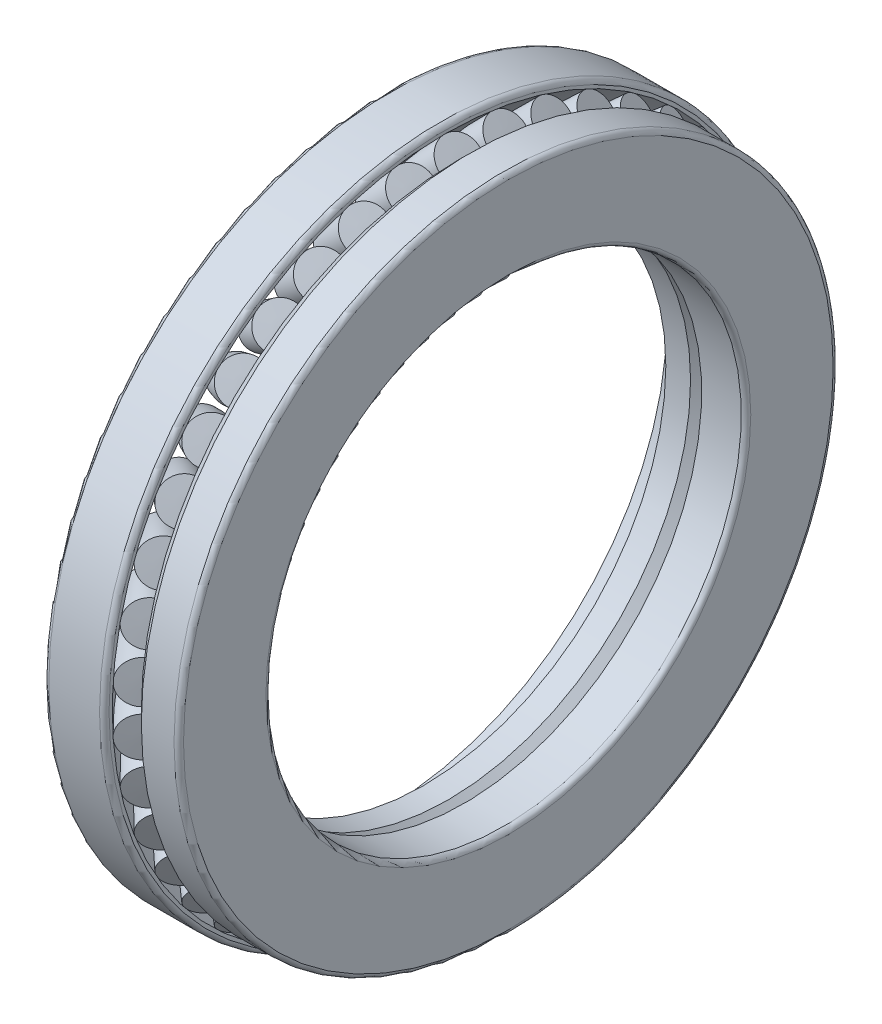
from build123d import *

# Parameters (mm, degrees)
CIRCULAR_PATTERN1_COUNT = 42


with BuildPart() as part:
    # Sketch1 → Revolve1 (revolve)
    with BuildSketch(Plane.XY, mode=Mode.PRIVATE) as revolve1_sk:
        with BuildLine():
            Line((-1, 106), (-1, 105))
            ThreePointArc((-1, 105), (-8.404844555, 97.260372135), (-15.223921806, 89))
            Line((-15.223921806, 89), (-20, 89))
            Line((-20, 89), (-20, 106))
            ThreePointArc((-20, 106), (-19.560660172, 107.060660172), (-18.5, 107.5))
            Line((-18.5, 107.5), (-2.5, 107.5))
            ThreePointArc((-2.5, 107.5), (-1.439339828, 107.060660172), (-1, 106))
        make_face()
    revolve(revolve1_sk.sketch.rotate(Axis((-62.403103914, 0, 0), (1, 0, 0)), 90), axis=Axis((-62.403103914, 0, 0), (1, 0, 0)))


with BuildPart() as body_2:
    # Sketch2 → Revolve2 (revolve)
    with BuildSketch(Plane.XY, mode=Mode.PRIVATE) as revolve2_sk:
        with BuildLine():
            Line((3.596194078, 100.403805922), (-9.239420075, 87.56819177))
            Line((-9.239420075, 87.56819177), (-13.223921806, 91.552693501))
            ThreePointArc((-13.223921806, 91.552693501), (-7.352309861, 98.431585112), (-1.067114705, 104.934761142))
            Line((-1.067114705, 104.934761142), (3.596194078, 100.403805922))
        make_face()
    revolve(revolve2_sk.sketch.rotate(Axis((-9.239420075, 87.56819177, 0), (0.7071067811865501, 0.707106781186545, 0)), 180), axis=Axis((-9.239420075, 87.56819177, 0), (0.7071067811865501, 0.707106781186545, 0)))


with BuildPart() as circular_pattern1_1:
    # Circular-Pattern1: pattern copy
    add(body_2.part.rotate(Axis((0, 0, 0), (1, 0, 0)), 1 * 360 / CIRCULAR_PATTERN1_COUNT))


with BuildPart() as circular_pattern1_2:
    # Circular-Pattern1: pattern copy
    add(body_2.part.rotate(Axis((0, 0, 0), (1, 0, 0)), 2 * 360 / CIRCULAR_PATTERN1_COUNT))


with BuildPart() as circular_pattern1_3:
    # Circular-Pattern1: pattern copy
    add(body_2.part.rotate(Axis((0, 0, 0), (1, 0, 0)), 3 * 360 / CIRCULAR_PATTERN1_COUNT))


with BuildPart() as circular_pattern1_4:
    # Circular-Pattern1: pattern copy
    add(body_2.part.rotate(Axis((0, 0, 0), (1, 0, 0)), 4 * 360 / CIRCULAR_PATTERN1_COUNT))


with BuildPart() as circular_pattern1_5:
    # Circular-Pattern1: pattern copy
    add(body_2.part.rotate(Axis((0, 0, 0), (1, 0, 0)), 5 * 360 / CIRCULAR_PATTERN1_COUNT))


with BuildPart() as circular_pattern1_6:
    # Circular-Pattern1: pattern copy
    add(body_2.part.rotate(Axis((0, 0, 0), (1, 0, 0)), 6 * 360 / CIRCULAR_PATTERN1_COUNT))


with BuildPart() as circular_pattern1_7:
    # Circular-Pattern1: pattern copy
    add(body_2.part.rotate(Axis((0, 0, 0), (1, 0, 0)), 7 * 360 / CIRCULAR_PATTERN1_COUNT))


with BuildPart() as circular_pattern1_8:
    # Circular-Pattern1: pattern copy
    add(body_2.part.rotate(Axis((0, 0, 0), (1, 0, 0)), 8 * 360 / CIRCULAR_PATTERN1_COUNT))


with BuildPart() as circular_pattern1_9:
    # Circular-Pattern1: pattern copy
    add(body_2.part.rotate(Axis((0, 0, 0), (1, 0, 0)), 9 * 360 / CIRCULAR_PATTERN1_COUNT))


with BuildPart() as circular_pattern1_10:
    # Circular-Pattern1: pattern copy
    add(body_2.part.rotate(Axis((0, 0, 0), (1, 0, 0)), 10 * 360 / CIRCULAR_PATTERN1_COUNT))


with BuildPart() as circular_pattern1_11:
    # Circular-Pattern1: pattern copy
    add(body_2.part.rotate(Axis((0, 0, 0), (1, 0, 0)), 11 * 360 / CIRCULAR_PATTERN1_COUNT))


with BuildPart() as circular_pattern1_12:
    # Circular-Pattern1: pattern copy
    add(body_2.part.rotate(Axis((0, 0, 0), (1, 0, 0)), 12 * 360 / CIRCULAR_PATTERN1_COUNT))


with BuildPart() as circular_pattern1_13:
    # Circular-Pattern1: pattern copy
    add(body_2.part.rotate(Axis((0, 0, 0), (1, 0, 0)), 13 * 360 / CIRCULAR_PATTERN1_COUNT))


with BuildPart() as circular_pattern1_14:
    # Circular-Pattern1: pattern copy
    add(body_2.part.rotate(Axis((0, 0, 0), (1, 0, 0)), 14 * 360 / CIRCULAR_PATTERN1_COUNT))


with BuildPart() as circular_pattern1_15:
    # Circular-Pattern1: pattern copy
    add(body_2.part.rotate(Axis((0, 0, 0), (1, 0, 0)), 15 * 360 / CIRCULAR_PATTERN1_COUNT))


with BuildPart() as circular_pattern1_16:
    # Circular-Pattern1: pattern copy
    add(body_2.part.rotate(Axis((0, 0, 0), (1, 0, 0)), 16 * 360 / CIRCULAR_PATTERN1_COUNT))


with BuildPart() as circular_pattern1_17:
    # Circular-Pattern1: pattern copy
    add(body_2.part.rotate(Axis((0, 0, 0), (1, 0, 0)), 17 * 360 / CIRCULAR_PATTERN1_COUNT))


with BuildPart() as circular_pattern1_18:
    # Circular-Pattern1: pattern copy
    add(body_2.part.rotate(Axis((0, 0, 0), (1, 0, 0)), 18 * 360 / CIRCULAR_PATTERN1_COUNT))


with BuildPart() as circular_pattern1_19:
    # Circular-Pattern1: pattern copy
    add(body_2.part.rotate(Axis((0, 0, 0), (1, 0, 0)), 19 * 360 / CIRCULAR_PATTERN1_COUNT))


with BuildPart() as circular_pattern1_20:
    # Circular-Pattern1: pattern copy
    add(body_2.part.rotate(Axis((0, 0, 0), (1, 0, 0)), 20 * 360 / CIRCULAR_PATTERN1_COUNT))


with BuildPart() as circular_pattern1_21:
    # Circular-Pattern1: pattern copy
    add(body_2.part.rotate(Axis((0, 0, 0), (1, 0, 0)), 21 * 360 / CIRCULAR_PATTERN1_COUNT))


with BuildPart() as circular_pattern1_22:
    # Circular-Pattern1: pattern copy
    add(body_2.part.rotate(Axis((0, 0, 0), (1, 0, 0)), 22 * 360 / CIRCULAR_PATTERN1_COUNT))


with BuildPart() as circular_pattern1_23:
    # Circular-Pattern1: pattern copy
    add(body_2.part.rotate(Axis((0, 0, 0), (1, 0, 0)), 23 * 360 / CIRCULAR_PATTERN1_COUNT))


with BuildPart() as circular_pattern1_24:
    # Circular-Pattern1: pattern copy
    add(body_2.part.rotate(Axis((0, 0, 0), (1, 0, 0)), 24 * 360 / CIRCULAR_PATTERN1_COUNT))


with BuildPart() as circular_pattern1_25:
    # Circular-Pattern1: pattern copy
    add(body_2.part.rotate(Axis((0, 0, 0), (1, 0, 0)), 25 * 360 / CIRCULAR_PATTERN1_COUNT))


with BuildPart() as circular_pattern1_26:
    # Circular-Pattern1: pattern copy
    add(body_2.part.rotate(Axis((0, 0, 0), (1, 0, 0)), 26 * 360 / CIRCULAR_PATTERN1_COUNT))


with BuildPart() as circular_pattern1_27:
    # Circular-Pattern1: pattern copy
    add(body_2.part.rotate(Axis((0, 0, 0), (1, 0, 0)), 27 * 360 / CIRCULAR_PATTERN1_COUNT))


with BuildPart() as circular_pattern1_28:
    # Circular-Pattern1: pattern copy
    add(body_2.part.rotate(Axis((0, 0, 0), (1, 0, 0)), 28 * 360 / CIRCULAR_PATTERN1_COUNT))


with BuildPart() as circular_pattern1_29:
    # Circular-Pattern1: pattern copy
    add(body_2.part.rotate(Axis((0, 0, 0), (1, 0, 0)), 29 * 360 / CIRCULAR_PATTERN1_COUNT))


with BuildPart() as circular_pattern1_30:
    # Circular-Pattern1: pattern copy
    add(body_2.part.rotate(Axis((0, 0, 0), (1, 0, 0)), 30 * 360 / CIRCULAR_PATTERN1_COUNT))


with BuildPart() as circular_pattern1_31:
    # Circular-Pattern1: pattern copy
    add(body_2.part.rotate(Axis((0, 0, 0), (1, 0, 0)), 31 * 360 / CIRCULAR_PATTERN1_COUNT))


with BuildPart() as circular_pattern1_32:
    # Circular-Pattern1: pattern copy
    add(body_2.part.rotate(Axis((0, 0, 0), (1, 0, 0)), 32 * 360 / CIRCULAR_PATTERN1_COUNT))


with BuildPart() as circular_pattern1_33:
    # Circular-Pattern1: pattern copy
    add(body_2.part.rotate(Axis((0, 0, 0), (1, 0, 0)), 33 * 360 / CIRCULAR_PATTERN1_COUNT))


with BuildPart() as circular_pattern1_34:
    # Circular-Pattern1: pattern copy
    add(body_2.part.rotate(Axis((0, 0, 0), (1, 0, 0)), 34 * 360 / CIRCULAR_PATTERN1_COUNT))


with BuildPart() as circular_pattern1_35:
    # Circular-Pattern1: pattern copy
    add(body_2.part.rotate(Axis((0, 0, 0), (1, 0, 0)), 35 * 360 / CIRCULAR_PATTERN1_COUNT))


with BuildPart() as circular_pattern1_36:
    # Circular-Pattern1: pattern copy
    add(body_2.part.rotate(Axis((0, 0, 0), (1, 0, 0)), 36 * 360 / CIRCULAR_PATTERN1_COUNT))


with BuildPart() as circular_pattern1_37:
    # Circular-Pattern1: pattern copy
    add(body_2.part.rotate(Axis((0, 0, 0), (1, 0, 0)), 37 * 360 / CIRCULAR_PATTERN1_COUNT))


with BuildPart() as circular_pattern1_38:
    # Circular-Pattern1: pattern copy
    add(body_2.part.rotate(Axis((0, 0, 0), (1, 0, 0)), 38 * 360 / CIRCULAR_PATTERN1_COUNT))


with BuildPart() as circular_pattern1_39:
    # Circular-Pattern1: pattern copy
    add(body_2.part.rotate(Axis((0, 0, 0), (1, 0, 0)), 39 * 360 / CIRCULAR_PATTERN1_COUNT))


with BuildPart() as circular_pattern1_40:
    # Circular-Pattern1: pattern copy
    add(body_2.part.rotate(Axis((0, 0, 0), (1, 0, 0)), 40 * 360 / CIRCULAR_PATTERN1_COUNT))


with BuildPart() as circular_pattern1_41:
    # Circular-Pattern1: pattern copy
    add(body_2.part.rotate(Axis((0, 0, 0), (1, 0, 0)), 41 * 360 / CIRCULAR_PATTERN1_COUNT))


with BuildPart() as body_44:
    # Sketch3 → Revolve3 (revolve)
    with BuildSketch(Plane.XY, mode=Mode.PRIVATE) as revolve3_sk:
        with BuildLine():
            Line((-7.807611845, 81.583690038), (-7.807611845, 76.5))
            Line((-7.807611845, 76.5), (0, 76.5))
            Line((0, 76.5), (2.5, 79.041845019))
            Line((2.5, 79.041845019), (5, 75))
            Line((5, 75), (17.5, 75))
            ThreePointArc((17.5, 75), (18.560660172, 75.439339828), (19, 76.5))
            Line((19, 76.5), (19, 102.5))
            ThreePointArc((19, 102.5), (18.560660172, 103.560660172), (17.5, 104))
            Line((17.5, 104), (7.192388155, 104))
            Line((7.192388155, 104), (3.596194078, 100.403805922))
            Line((3.596194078, 100.403805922), (8.192388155, 95.807611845))
            ThreePointArc((8.192388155, 95.807611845), (0.452760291, 88.40276729), (-7.807611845, 81.583690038))
        make_face()
    revolve(revolve3_sk.sketch.rotate(Axis((-62.403103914, 0, 0), (1, 0, 0)), 90), axis=Axis((-62.403103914, 0, 0), (1, 0, 0)))


solid = Compound([part.part, body_2.part, circular_pattern1_1.part, circular_pattern1_2.part, circular_pattern1_3.part, circular_pattern1_4.part, circular_pattern1_5.part, circular_pattern1_6.part, circular_pattern1_7.part, circular_pattern1_8.part, circular_pattern1_9.part, circular_pattern1_10.part, circular_pattern1_11.part, circular_pattern1_12.part, circular_pattern1_13.part, circular_pattern1_14.part, circular_pattern1_15.part, circular_pattern1_16.part, circular_pattern1_17.part, circular_pattern1_18.part, circular_pattern1_19.part, circular_pattern1_20.part, circular_pattern1_21.part, circular_pattern1_22.part, circular_pattern1_23.part, circular_pattern1_24.part, circular_pattern1_25.part, circular_pattern1_26.part, circular_pattern1_27.part, circular_pattern1_28.part, circular_pattern1_29.part, circular_pattern1_30.part, circular_pattern1_31.part, circular_pattern1_32.part, circular_pattern1_33.part, circular_pattern1_34.part, circular_pattern1_35.part, circular_pattern1_36.part, circular_pattern1_37.part, circular_pattern1_38.part, circular_pattern1_39.part, circular_pattern1_40.part, circular_pattern1_41.part, body_44.part])
